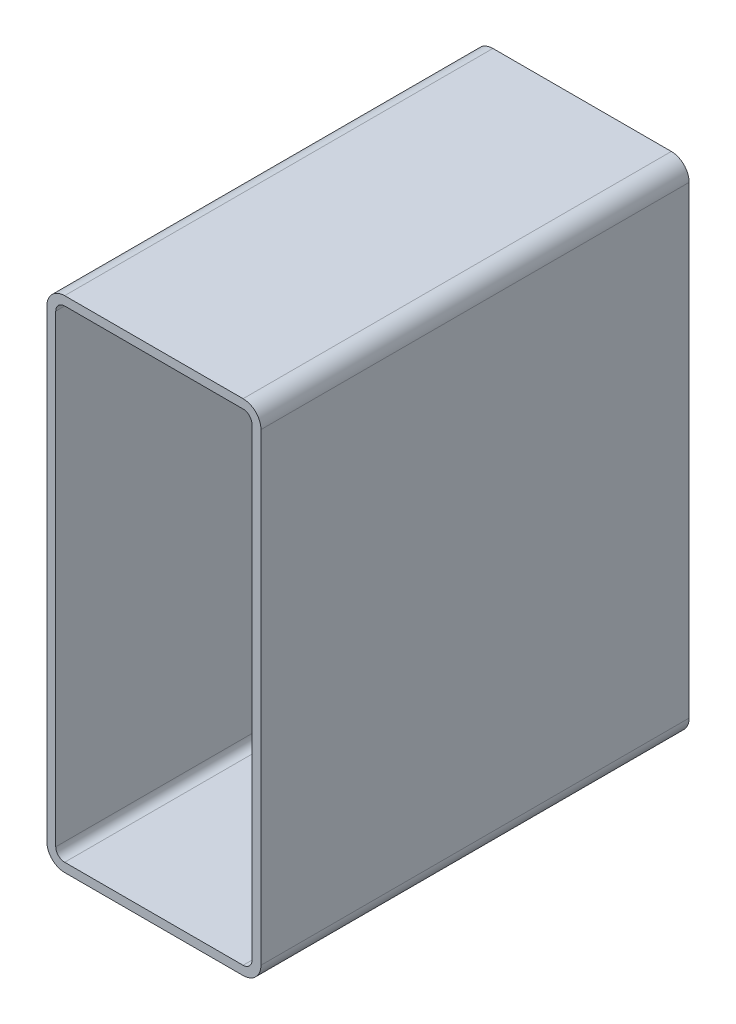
ISO-10303-21;
HEADER;
FILE_DESCRIPTION(('STEP AP214'),'2;1');
FILE_NAME('part.step','',(''),(''),'','','');
FILE_SCHEMA(('AUTOMOTIVE_DESIGN { 1 0 10303 214 1 1 1 1 }'));
ENDSEC;
DATA;
#1=APPLICATION_CONTEXT('core data for automotive mechanical design processes');
#2=APPLICATION_PROTOCOL_DEFINITION('international standard','automotive_design',2000,#1);
#3=PRODUCT_CONTEXT('',#1,'mechanical');
#4=PRODUCT('Part','Part','',(#3));
#5=PRODUCT_RELATED_PRODUCT_CATEGORY('part','',(#4));
#6=PRODUCT_DEFINITION_FORMATION('','',#4);
#7=PRODUCT_DEFINITION_CONTEXT('part definition',#1,'design');
#8=PRODUCT_DEFINITION('design','',#6,#7);
#9=PRODUCT_DEFINITION_SHAPE('','',#8);
#10=(LENGTH_UNIT() NAMED_UNIT(*) SI_UNIT(.MILLI.,.METRE.));
#11=(NAMED_UNIT(*) PLANE_ANGLE_UNIT() SI_UNIT($,.RADIAN.));
#12=(NAMED_UNIT(*) SI_UNIT($,.STERADIAN.) SOLID_ANGLE_UNIT());
#13=UNCERTAINTY_MEASURE_WITH_UNIT(LENGTH_MEASURE(1.E-05),#10,'distance_accuracy_value','');
#14=(GEOMETRIC_REPRESENTATION_CONTEXT(3) GLOBAL_UNCERTAINTY_ASSIGNED_CONTEXT((#13)) GLOBAL_UNIT_ASSIGNED_CONTEXT((#10,
#11,#12)) REPRESENTATION_CONTEXT('',''));
#15=CARTESIAN_POINT('',(0.,0.,0.));
#16=DIRECTION('',(0.,0.,1.));
#17=DIRECTION('',(1.,0.,0.));
#18=AXIS2_PLACEMENT_3D('',#15,#16,#17);
#19=CARTESIAN_POINT('',(12.7473013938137,344.728679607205,304.8));
#20=DIRECTION('',(0.,0.,1.));
#21=DIRECTION('',(1.,0.,0.));
#22=AXIS2_PLACEMENT_3D('',#19,#20,#21);
#23=PLANE('',#22);
#24=CARTESIAN_POINT('',(12.7473013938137,344.728679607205,304.8));
#25=DIRECTION('',(0.,0.,1.));
#26=DIRECTION('',(1.,0.,0.));
#27=AXIS2_PLACEMENT_3D('',#24,#25,#26);
#28=CIRCLE('',#27,12.7);
#29=CARTESIAN_POINT('',(12.7473013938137,357.428679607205,304.8));
#30=VERTEX_POINT('',#29);
#31=CARTESIAN_POINT('',(0.0473013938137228,344.728679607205,304.8));
#32=VERTEX_POINT('',#31);
#33=EDGE_CURVE('E211',#30,#32,#28,.T.);
#34=ORIENTED_EDGE('',*,*,#33,.T.);
#35=DIRECTION('',(0.,-1.,0.));
#36=VECTOR('',#35,1.);
#37=CARTESIAN_POINT('',(0.0473013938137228,14.5286796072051,304.8));
#38=LINE('',#37,#36);
#39=CARTESIAN_POINT('',(0.0473013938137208,14.5286796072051,304.8));
#40=VERTEX_POINT('',#39);
#41=EDGE_CURVE('E214',#32,#40,#38,.T.);
#42=ORIENTED_EDGE('',*,*,#41,.T.);
#43=CARTESIAN_POINT('',(12.7473013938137,14.5286796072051,304.8));
#44=DIRECTION('',(0.,0.,1.));
#45=DIRECTION('',(1.,0.,0.));
#46=AXIS2_PLACEMENT_3D('',#43,#44,#45);
#47=CIRCLE('',#46,12.7);
#48=CARTESIAN_POINT('',(12.7473013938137,1.82867960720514,304.8));
#49=VERTEX_POINT('',#48);
#50=EDGE_CURVE('E217',#40,#49,#47,.T.);
#51=ORIENTED_EDGE('',*,*,#50,.T.);
#52=DIRECTION('',(1.,0.,0.));
#53=VECTOR('',#52,1.);
#54=CARTESIAN_POINT('',(139.747301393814,1.82867960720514,304.8));
#55=LINE('',#54,#53);
#56=CARTESIAN_POINT('',(139.747301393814,1.82867960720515,304.8));
#57=VERTEX_POINT('',#56);
#58=EDGE_CURVE('E219',#49,#57,#55,.T.);
#59=ORIENTED_EDGE('',*,*,#58,.T.);
#60=CARTESIAN_POINT('',(139.747301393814,14.5286796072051,304.8));
#61=DIRECTION('',(0.,0.,1.));
#62=DIRECTION('',(1.,0.,0.));
#63=AXIS2_PLACEMENT_3D('',#60,#61,#62);
#64=CIRCLE('',#63,12.7);
#65=CARTESIAN_POINT('',(152.447301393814,14.5286796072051,304.8));
#66=VERTEX_POINT('',#65);
#67=EDGE_CURVE('E221',#57,#66,#64,.T.);
#68=ORIENTED_EDGE('',*,*,#67,.T.);
#69=DIRECTION('',(0.,1.,0.));
#70=VECTOR('',#69,1.);
#71=CARTESIAN_POINT('',(152.447301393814,344.728679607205,304.8));
#72=LINE('',#71,#70);
#73=CARTESIAN_POINT('',(152.447301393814,344.728679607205,304.8));
#74=VERTEX_POINT('',#73);
#75=EDGE_CURVE('E223',#66,#74,#72,.T.);
#76=ORIENTED_EDGE('',*,*,#75,.T.);
#77=CARTESIAN_POINT('',(139.747301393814,344.728679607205,304.8));
#78=DIRECTION('',(0.,0.,1.));
#79=DIRECTION('',(1.,0.,0.));
#80=AXIS2_PLACEMENT_3D('',#77,#78,#79);
#81=CIRCLE('',#80,12.7);
#82=CARTESIAN_POINT('',(139.747301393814,357.428679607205,304.8));
#83=VERTEX_POINT('',#82);
#84=EDGE_CURVE('E225',#74,#83,#81,.T.);
#85=ORIENTED_EDGE('',*,*,#84,.T.);
#86=DIRECTION('',(-1.,0.,0.));
#87=VECTOR('',#86,1.);
#88=CARTESIAN_POINT('',(12.7473013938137,357.428679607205,304.8));
#89=LINE('',#88,#87);
#90=EDGE_CURVE('E227',#83,#30,#89,.T.);
#91=ORIENTED_EDGE('',*,*,#90,.T.);
#92=EDGE_LOOP('',(#34,#42,#51,#59,#68,#76,#85,#91));
#93=FACE_BOUND('',#92,.T.);
#94=DIRECTION('',(0.,-1.,0.));
#95=VECTOR('',#94,1.);
#96=CARTESIAN_POINT('',(6.39730139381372,14.5286796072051,304.8));
#97=LINE('',#96,#95);
#98=CARTESIAN_POINT('',(6.39730139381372,344.728679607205,304.8));
#99=VERTEX_POINT('',#98);
#100=CARTESIAN_POINT('',(6.39730139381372,14.5286796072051,304.8));
#101=VERTEX_POINT('',#100);
#102=EDGE_CURVE('E154',#99,#101,#97,.T.);
#103=ORIENTED_EDGE('',*,*,#102,.F.);
#104=CARTESIAN_POINT('',(12.7473013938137,344.728679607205,304.8));
#105=DIRECTION('',(0.,0.,1.));
#106=DIRECTION('',(1.,0.,0.));
#107=AXIS2_PLACEMENT_3D('',#104,#105,#106);
#108=CIRCLE('',#107,6.35000000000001);
#109=CARTESIAN_POINT('',(12.7473013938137,351.078679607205,304.8));
#110=VERTEX_POINT('',#109);
#111=EDGE_CURVE('E146',#110,#99,#108,.T.);
#112=ORIENTED_EDGE('',*,*,#111,.F.);
#113=DIRECTION('',(-1.,0.,0.));
#114=VECTOR('',#113,1.);
#115=CARTESIAN_POINT('',(12.7473013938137,351.078679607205,304.8));
#116=LINE('',#115,#114);
#117=CARTESIAN_POINT('',(139.747301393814,351.078679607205,304.8));
#118=VERTEX_POINT('',#117);
#119=EDGE_CURVE('E179',#118,#110,#116,.T.);
#120=ORIENTED_EDGE('',*,*,#119,.F.);
#121=CARTESIAN_POINT('',(139.747301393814,344.728679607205,304.8));
#122=DIRECTION('',(0.,0.,1.));
#123=DIRECTION('',(1.,0.,0.));
#124=AXIS2_PLACEMENT_3D('',#121,#122,#123);
#125=CIRCLE('',#124,6.35000000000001);
#126=CARTESIAN_POINT('',(146.097301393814,344.728679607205,304.8));
#127=VERTEX_POINT('',#126);
#128=EDGE_CURVE('E177',#127,#118,#125,.T.);
#129=ORIENTED_EDGE('',*,*,#128,.F.);
#130=DIRECTION('',(0.,1.,0.));
#131=VECTOR('',#130,1.);
#132=CARTESIAN_POINT('',(146.097301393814,344.728679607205,304.8));
#133=LINE('',#132,#131);
#134=CARTESIAN_POINT('',(146.097301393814,14.5286796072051,304.8));
#135=VERTEX_POINT('',#134);
#136=EDGE_CURVE('E175',#135,#127,#133,.T.);
#137=ORIENTED_EDGE('',*,*,#136,.F.);
#138=CARTESIAN_POINT('',(139.747301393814,14.5286796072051,304.8));
#139=DIRECTION('',(0.,0.,1.));
#140=DIRECTION('',(1.,0.,0.));
#141=AXIS2_PLACEMENT_3D('',#138,#139,#140);
#142=CIRCLE('',#141,6.35);
#143=CARTESIAN_POINT('',(139.747301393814,8.17867960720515,304.8));
#144=VERTEX_POINT('',#143);
#145=EDGE_CURVE('E173',#144,#135,#142,.T.);
#146=ORIENTED_EDGE('',*,*,#145,.F.);
#147=DIRECTION('',(1.,0.,0.));
#148=VECTOR('',#147,1.);
#149=CARTESIAN_POINT('',(139.747301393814,8.17867960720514,304.8));
#150=LINE('',#149,#148);
#151=CARTESIAN_POINT('',(12.7473013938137,8.17867960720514,304.8));
#152=VERTEX_POINT('',#151);
#153=EDGE_CURVE('E169',#152,#144,#150,.T.);
#154=ORIENTED_EDGE('',*,*,#153,.F.);
#155=CARTESIAN_POINT('',(12.7473013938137,14.5286796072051,304.8));
#156=DIRECTION('',(0.,0.,1.));
#157=DIRECTION('',(1.,0.,0.));
#158=AXIS2_PLACEMENT_3D('',#155,#156,#157);
#159=CIRCLE('',#158,6.35);
#160=EDGE_CURVE('E167',#101,#152,#159,.T.);
#161=ORIENTED_EDGE('',*,*,#160,.F.);
#162=EDGE_LOOP('',(#103,#112,#120,#129,#137,#146,#154,#161));
#163=FACE_BOUND('',#162,.T.);
#164=ADVANCED_FACE('F33',(#93,#163),#23,.T.);
#165=CARTESIAN_POINT('',(12.7473013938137,344.728679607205,0.));
#166=DIRECTION('',(0.,0.,1.));
#167=DIRECTION('',(1.,0.,0.));
#168=AXIS2_PLACEMENT_3D('',#165,#166,#167);
#169=PLANE('',#168);
#170=CARTESIAN_POINT('',(12.7473013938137,344.728679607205,0.));
#171=DIRECTION('',(0.,0.,1.));
#172=DIRECTION('',(1.,0.,0.));
#173=AXIS2_PLACEMENT_3D('',#170,#171,#172);
#174=CIRCLE('',#173,12.7);
#175=CARTESIAN_POINT('',(12.7473013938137,357.428679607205,0.));
#176=VERTEX_POINT('',#175);
#177=CARTESIAN_POINT('',(0.0473013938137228,344.728679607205,0.));
#178=VERTEX_POINT('',#177);
#179=EDGE_CURVE('E162',#176,#178,#174,.T.);
#180=ORIENTED_EDGE('',*,*,#179,.F.);
#181=DIRECTION('',(-1.,0.,0.));
#182=VECTOR('',#181,1.);
#183=CARTESIAN_POINT('',(12.7473013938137,357.428679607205,0.));
#184=LINE('',#183,#182);
#185=CARTESIAN_POINT('',(139.747301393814,357.428679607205,0.));
#186=VERTEX_POINT('',#185);
#187=EDGE_CURVE('E215',#186,#176,#184,.T.);
#188=ORIENTED_EDGE('',*,*,#187,.F.);
#189=CARTESIAN_POINT('',(139.747301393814,344.728679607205,0.));
#190=DIRECTION('',(0.,0.,1.));
#191=DIRECTION('',(1.,0.,0.));
#192=AXIS2_PLACEMENT_3D('',#189,#190,#191);
#193=CIRCLE('',#192,12.7);
#194=CARTESIAN_POINT('',(152.447301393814,344.728679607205,0.));
#195=VERTEX_POINT('',#194);
#196=EDGE_CURVE('E242',#195,#186,#193,.T.);
#197=ORIENTED_EDGE('',*,*,#196,.F.);
#198=DIRECTION('',(0.,1.,0.));
#199=VECTOR('',#198,1.);
#200=CARTESIAN_POINT('',(152.447301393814,344.728679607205,0.));
#201=LINE('',#200,#199);
#202=CARTESIAN_POINT('',(152.447301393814,14.5286796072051,0.));
#203=VERTEX_POINT('',#202);
#204=EDGE_CURVE('E240',#203,#195,#201,.T.);
#205=ORIENTED_EDGE('',*,*,#204,.F.);
#206=CARTESIAN_POINT('',(139.747301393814,14.5286796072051,0.));
#207=DIRECTION('',(0.,0.,1.));
#208=DIRECTION('',(1.,0.,0.));
#209=AXIS2_PLACEMENT_3D('',#206,#207,#208);
#210=CIRCLE('',#209,12.7);
#211=CARTESIAN_POINT('',(139.747301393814,1.82867960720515,0.));
#212=VERTEX_POINT('',#211);
#213=EDGE_CURVE('E238',#212,#203,#210,.T.);
#214=ORIENTED_EDGE('',*,*,#213,.F.);
#215=DIRECTION('',(1.,0.,0.));
#216=VECTOR('',#215,1.);
#217=CARTESIAN_POINT('',(139.747301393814,1.82867960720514,0.));
#218=LINE('',#217,#216);
#219=CARTESIAN_POINT('',(12.7473013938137,1.82867960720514,0.));
#220=VERTEX_POINT('',#219);
#221=EDGE_CURVE('E236',#220,#212,#218,.T.);
#222=ORIENTED_EDGE('',*,*,#221,.F.);
#223=CARTESIAN_POINT('',(12.7473013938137,14.5286796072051,0.));
#224=DIRECTION('',(0.,0.,1.));
#225=DIRECTION('',(1.,0.,0.));
#226=AXIS2_PLACEMENT_3D('',#223,#224,#225);
#227=CIRCLE('',#226,12.7);
#228=CARTESIAN_POINT('',(0.0473013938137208,14.5286796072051,0.));
#229=VERTEX_POINT('',#228);
#230=EDGE_CURVE('E234',#229,#220,#227,.T.);
#231=ORIENTED_EDGE('',*,*,#230,.F.);
#232=DIRECTION('',(0.,-1.,0.));
#233=VECTOR('',#232,1.);
#234=CARTESIAN_POINT('',(0.0473013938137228,14.5286796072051,0.));
#235=LINE('',#234,#233);
#236=EDGE_CURVE('E232',#178,#229,#235,.T.);
#237=ORIENTED_EDGE('',*,*,#236,.F.);
#238=EDGE_LOOP('',(#180,#188,#197,#205,#214,#222,#231,#237));
#239=FACE_BOUND('',#238,.T.);
#240=CARTESIAN_POINT('',(12.7473013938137,344.728679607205,0.));
#241=DIRECTION('',(0.,0.,1.));
#242=DIRECTION('',(1.,0.,0.));
#243=AXIS2_PLACEMENT_3D('',#240,#241,#242);
#244=CIRCLE('',#243,6.35000000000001);
#245=CARTESIAN_POINT('',(12.7473013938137,351.078679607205,0.));
#246=VERTEX_POINT('',#245);
#247=CARTESIAN_POINT('',(6.39730139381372,344.728679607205,0.));
#248=VERTEX_POINT('',#247);
#249=EDGE_CURVE('E56',#246,#248,#244,.T.);
#250=ORIENTED_EDGE('',*,*,#249,.T.);
#251=DIRECTION('',(0.,-1.,0.));
#252=VECTOR('',#251,1.);
#253=CARTESIAN_POINT('',(6.39730139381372,14.5286796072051,0.));
#254=LINE('',#253,#252);
#255=CARTESIAN_POINT('',(6.39730139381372,14.5286796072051,0.));
#256=VERTEX_POINT('',#255);
#257=EDGE_CURVE('E161',#248,#256,#254,.T.);
#258=ORIENTED_EDGE('',*,*,#257,.T.);
#259=CARTESIAN_POINT('',(12.7473013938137,14.5286796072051,0.));
#260=DIRECTION('',(0.,0.,1.));
#261=DIRECTION('',(1.,0.,0.));
#262=AXIS2_PLACEMENT_3D('',#259,#260,#261);
#263=CIRCLE('',#262,6.35);
#264=CARTESIAN_POINT('',(12.7473013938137,8.17867960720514,0.));
#265=VERTEX_POINT('',#264);
#266=EDGE_CURVE('E183',#256,#265,#263,.T.);
#267=ORIENTED_EDGE('',*,*,#266,.T.);
#268=DIRECTION('',(1.,0.,0.));
#269=VECTOR('',#268,1.);
#270=CARTESIAN_POINT('',(139.747301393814,8.17867960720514,0.));
#271=LINE('',#270,#269);
#272=CARTESIAN_POINT('',(139.747301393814,8.17867960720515,0.));
#273=VERTEX_POINT('',#272);
#274=EDGE_CURVE('E186',#265,#273,#271,.T.);
#275=ORIENTED_EDGE('',*,*,#274,.T.);
#276=CARTESIAN_POINT('',(139.747301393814,14.5286796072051,0.));
#277=DIRECTION('',(0.,0.,1.));
#278=DIRECTION('',(1.,0.,0.));
#279=AXIS2_PLACEMENT_3D('',#276,#277,#278);
#280=CIRCLE('',#279,6.35);
#281=CARTESIAN_POINT('',(146.097301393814,14.5286796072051,0.));
#282=VERTEX_POINT('',#281);
#283=EDGE_CURVE('E189',#273,#282,#280,.T.);
#284=ORIENTED_EDGE('',*,*,#283,.T.);
#285=DIRECTION('',(0.,1.,0.));
#286=VECTOR('',#285,1.);
#287=CARTESIAN_POINT('',(146.097301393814,344.728679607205,0.));
#288=LINE('',#287,#286);
#289=CARTESIAN_POINT('',(146.097301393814,344.728679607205,0.));
#290=VERTEX_POINT('',#289);
#291=EDGE_CURVE('E192',#282,#290,#288,.T.);
#292=ORIENTED_EDGE('',*,*,#291,.T.);
#293=CARTESIAN_POINT('',(139.747301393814,344.728679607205,0.));
#294=DIRECTION('',(0.,0.,1.));
#295=DIRECTION('',(1.,0.,0.));
#296=AXIS2_PLACEMENT_3D('',#293,#294,#295);
#297=CIRCLE('',#296,6.35000000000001);
#298=CARTESIAN_POINT('',(139.747301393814,351.078679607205,0.));
#299=VERTEX_POINT('',#298);
#300=EDGE_CURVE('E195',#290,#299,#297,.T.);
#301=ORIENTED_EDGE('',*,*,#300,.T.);
#302=DIRECTION('',(-1.,0.,0.));
#303=VECTOR('',#302,1.);
#304=CARTESIAN_POINT('',(12.7473013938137,351.078679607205,0.));
#305=LINE('',#304,#303);
#306=EDGE_CURVE('E155',#299,#246,#305,.T.);
#307=ORIENTED_EDGE('',*,*,#306,.T.);
#308=EDGE_LOOP('',(#250,#258,#267,#275,#284,#292,#301,#307));
#309=FACE_BOUND('',#308,.T.);
#310=ADVANCED_FACE('F272',(#239,#309),#169,.F.);
#311=CARTESIAN_POINT('',(12.7473013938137,344.728679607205,304.8));
#312=DIRECTION('',(0.,0.,-1.));
#313=DIRECTION('',(-1.,0.,0.));
#314=AXIS2_PLACEMENT_3D('',#311,#312,#313);
#315=CYLINDRICAL_SURFACE('',#314,12.7);
#316=ORIENTED_EDGE('',*,*,#179,.T.);
#317=DIRECTION('',(0.,0.,-1.));
#318=VECTOR('',#317,1.);
#319=CARTESIAN_POINT('',(0.0473013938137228,344.728679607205,304.8));
#320=LINE('',#319,#318);
#321=EDGE_CURVE('E11',#32,#178,#320,.T.);
#322=ORIENTED_EDGE('',*,*,#321,.F.);
#323=ORIENTED_EDGE('',*,*,#33,.F.);
#324=DIRECTION('',(0.,0.,-1.));
#325=VECTOR('',#324,1.);
#326=CARTESIAN_POINT('',(12.7473013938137,357.428679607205,304.8));
#327=LINE('',#326,#325);
#328=EDGE_CURVE('E229',#30,#176,#327,.T.);
#329=ORIENTED_EDGE('',*,*,#328,.T.);
#330=EDGE_LOOP('',(#316,#322,#323,#329));
#331=FACE_BOUND('',#330,.T.);
#332=ADVANCED_FACE('F35',(#331),#315,.T.);
#333=CARTESIAN_POINT('',(0.0473013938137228,14.5286796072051,304.8));
#334=DIRECTION('',(1.,0.,0.));
#335=DIRECTION('',(0.,0.,-1.));
#336=AXIS2_PLACEMENT_3D('',#333,#334,#335);
#337=PLANE('',#336);
#338=ORIENTED_EDGE('',*,*,#236,.T.);
#339=DIRECTION('',(0.,0.,-1.));
#340=VECTOR('',#339,1.);
#341=CARTESIAN_POINT('',(0.0473013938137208,14.5286796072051,304.8));
#342=LINE('',#341,#340);
#343=EDGE_CURVE('E41',#40,#229,#342,.T.);
#344=ORIENTED_EDGE('',*,*,#343,.F.);
#345=ORIENTED_EDGE('',*,*,#41,.F.);
#346=ORIENTED_EDGE('',*,*,#321,.T.);
#347=EDGE_LOOP('',(#338,#344,#345,#346));
#348=FACE_BOUND('',#347,.T.);
#349=ADVANCED_FACE('F289',(#348),#337,.F.);
#350=CARTESIAN_POINT('',(12.7473013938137,14.5286796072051,304.8));
#351=DIRECTION('',(0.,0.,-1.));
#352=DIRECTION('',(-1.,0.,0.));
#353=AXIS2_PLACEMENT_3D('',#350,#351,#352);
#354=CYLINDRICAL_SURFACE('',#353,12.7);
#355=ORIENTED_EDGE('',*,*,#230,.T.);
#356=DIRECTION('',(0.,0.,-1.));
#357=VECTOR('',#356,1.);
#358=CARTESIAN_POINT('',(12.7473013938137,1.82867960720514,304.8));
#359=LINE('',#358,#357);
#360=EDGE_CURVE('E259',#49,#220,#359,.T.);
#361=ORIENTED_EDGE('',*,*,#360,.F.);
#362=ORIENTED_EDGE('',*,*,#50,.F.);
#363=ORIENTED_EDGE('',*,*,#343,.T.);
#364=EDGE_LOOP('',(#355,#361,#362,#363));
#365=FACE_BOUND('',#364,.T.);
#366=ADVANCED_FACE('F266',(#365),#354,.T.);
#367=CARTESIAN_POINT('',(139.747301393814,1.82867960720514,304.8));
#368=DIRECTION('',(0.,1.,0.));
#369=DIRECTION('',(0.,0.,1.));
#370=AXIS2_PLACEMENT_3D('',#367,#368,#369);
#371=PLANE('',#370);
#372=ORIENTED_EDGE('',*,*,#221,.T.);
#373=DIRECTION('',(0.,0.,-1.));
#374=VECTOR('',#373,1.);
#375=CARTESIAN_POINT('',(139.747301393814,1.82867960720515,304.8));
#376=LINE('',#375,#374);
#377=EDGE_CURVE('E256',#57,#212,#376,.T.);
#378=ORIENTED_EDGE('',*,*,#377,.F.);
#379=ORIENTED_EDGE('',*,*,#58,.F.);
#380=ORIENTED_EDGE('',*,*,#360,.T.);
#381=EDGE_LOOP('',(#372,#378,#379,#380));
#382=FACE_BOUND('',#381,.T.);
#383=ADVANCED_FACE('F278',(#382),#371,.F.);
#384=CARTESIAN_POINT('',(139.747301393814,14.5286796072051,304.8));
#385=DIRECTION('',(0.,0.,-1.));
#386=DIRECTION('',(-1.,0.,0.));
#387=AXIS2_PLACEMENT_3D('',#384,#385,#386);
#388=CYLINDRICAL_SURFACE('',#387,12.7);
#389=ORIENTED_EDGE('',*,*,#213,.T.);
#390=DIRECTION('',(0.,0.,-1.));
#391=VECTOR('',#390,1.);
#392=CARTESIAN_POINT('',(152.447301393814,14.5286796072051,304.8));
#393=LINE('',#392,#391);
#394=EDGE_CURVE('E253',#66,#203,#393,.T.);
#395=ORIENTED_EDGE('',*,*,#394,.F.);
#396=ORIENTED_EDGE('',*,*,#67,.F.);
#397=ORIENTED_EDGE('',*,*,#377,.T.);
#398=EDGE_LOOP('',(#389,#395,#396,#397));
#399=FACE_BOUND('',#398,.T.);
#400=ADVANCED_FACE('F282',(#399),#388,.T.);
#401=CARTESIAN_POINT('',(152.447301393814,344.728679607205,304.8));
#402=DIRECTION('',(-1.,0.,0.));
#403=DIRECTION('',(0.,0.,1.));
#404=AXIS2_PLACEMENT_3D('',#401,#402,#403);
#405=PLANE('',#404);
#406=ORIENTED_EDGE('',*,*,#204,.T.);
#407=DIRECTION('',(0.,0.,-1.));
#408=VECTOR('',#407,1.);
#409=CARTESIAN_POINT('',(152.447301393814,344.728679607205,304.8));
#410=LINE('',#409,#408);
#411=EDGE_CURVE('E250',#74,#195,#410,.T.);
#412=ORIENTED_EDGE('',*,*,#411,.F.);
#413=ORIENTED_EDGE('',*,*,#75,.F.);
#414=ORIENTED_EDGE('',*,*,#394,.T.);
#415=EDGE_LOOP('',(#406,#412,#413,#414));
#416=FACE_BOUND('',#415,.T.);
#417=ADVANCED_FACE('F302',(#416),#405,.F.);
#418=CARTESIAN_POINT('',(139.747301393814,344.728679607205,304.8));
#419=DIRECTION('',(0.,0.,-1.));
#420=DIRECTION('',(-1.,0.,0.));
#421=AXIS2_PLACEMENT_3D('',#418,#419,#420);
#422=CYLINDRICAL_SURFACE('',#421,12.7);
#423=ORIENTED_EDGE('',*,*,#196,.T.);
#424=DIRECTION('',(0.,0.,-1.));
#425=VECTOR('',#424,1.);
#426=CARTESIAN_POINT('',(139.747301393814,357.428679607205,304.8));
#427=LINE('',#426,#425);
#428=EDGE_CURVE('E247',#83,#186,#427,.T.);
#429=ORIENTED_EDGE('',*,*,#428,.F.);
#430=ORIENTED_EDGE('',*,*,#84,.F.);
#431=ORIENTED_EDGE('',*,*,#411,.T.);
#432=EDGE_LOOP('',(#423,#429,#430,#431));
#433=FACE_BOUND('',#432,.T.);
#434=ADVANCED_FACE('F300',(#433),#422,.T.);
#435=CARTESIAN_POINT('',(12.7473013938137,357.428679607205,304.8));
#436=DIRECTION('',(0.,-1.,0.));
#437=DIRECTION('',(0.,0.,-1.));
#438=AXIS2_PLACEMENT_3D('',#435,#436,#437);
#439=PLANE('',#438);
#440=ORIENTED_EDGE('',*,*,#187,.T.);
#441=ORIENTED_EDGE('',*,*,#328,.F.);
#442=ORIENTED_EDGE('',*,*,#90,.F.);
#443=ORIENTED_EDGE('',*,*,#428,.T.);
#444=EDGE_LOOP('',(#440,#441,#442,#443));
#445=FACE_BOUND('',#444,.T.);
#446=ADVANCED_FACE('F295',(#445),#439,.F.);
#447=CARTESIAN_POINT('',(12.7473013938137,344.728679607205,304.8));
#448=DIRECTION('',(0.,0.,-1.));
#449=DIRECTION('',(-1.,0.,0.));
#450=AXIS2_PLACEMENT_3D('',#447,#448,#449);
#451=CYLINDRICAL_SURFACE('',#450,6.35000000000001);
#452=ORIENTED_EDGE('',*,*,#249,.F.);
#453=DIRECTION('',(0.,0.,-1.));
#454=VECTOR('',#453,1.);
#455=CARTESIAN_POINT('',(12.7473013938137,351.078679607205,304.8));
#456=LINE('',#455,#454);
#457=EDGE_CURVE('E150',#110,#246,#456,.T.);
#458=ORIENTED_EDGE('',*,*,#457,.F.);
#459=ORIENTED_EDGE('',*,*,#111,.T.);
#460=DIRECTION('',(0.,0.,-1.));
#461=VECTOR('',#460,1.);
#462=CARTESIAN_POINT('',(6.39730139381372,344.728679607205,304.8));
#463=LINE('',#462,#461);
#464=EDGE_CURVE('E149',#99,#248,#463,.T.);
#465=ORIENTED_EDGE('',*,*,#464,.T.);
#466=EDGE_LOOP('',(#452,#458,#459,#465));
#467=FACE_BOUND('',#466,.T.);
#468=ADVANCED_FACE('F148',(#467),#451,.F.);
#469=CARTESIAN_POINT('',(6.39730139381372,14.5286796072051,304.8));
#470=DIRECTION('',(1.,0.,0.));
#471=DIRECTION('',(0.,0.,-1.));
#472=AXIS2_PLACEMENT_3D('',#469,#470,#471);
#473=PLANE('',#472);
#474=ORIENTED_EDGE('',*,*,#257,.F.);
#475=ORIENTED_EDGE('',*,*,#464,.F.);
#476=ORIENTED_EDGE('',*,*,#102,.T.);
#477=DIRECTION('',(0.,0.,-1.));
#478=VECTOR('',#477,1.);
#479=CARTESIAN_POINT('',(6.39730139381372,14.5286796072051,304.8));
#480=LINE('',#479,#478);
#481=EDGE_CURVE('E163',#101,#256,#480,.T.);
#482=ORIENTED_EDGE('',*,*,#481,.T.);
#483=EDGE_LOOP('',(#474,#475,#476,#482));
#484=FACE_BOUND('',#483,.T.);
#485=ADVANCED_FACE('F158',(#484),#473,.T.);
#486=CARTESIAN_POINT('',(12.7473013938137,14.5286796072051,304.8));
#487=DIRECTION('',(0.,0.,-1.));
#488=DIRECTION('',(-1.,0.,0.));
#489=AXIS2_PLACEMENT_3D('',#486,#487,#488);
#490=CYLINDRICAL_SURFACE('',#489,6.35);
#491=ORIENTED_EDGE('',*,*,#266,.F.);
#492=ORIENTED_EDGE('',*,*,#481,.F.);
#493=ORIENTED_EDGE('',*,*,#160,.T.);
#494=DIRECTION('',(0.,0.,-1.));
#495=VECTOR('',#494,1.);
#496=CARTESIAN_POINT('',(12.7473013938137,8.17867960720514,304.8));
#497=LINE('',#496,#495);
#498=EDGE_CURVE('E208',#152,#265,#497,.T.);
#499=ORIENTED_EDGE('',*,*,#498,.T.);
#500=EDGE_LOOP('',(#491,#492,#493,#499));
#501=FACE_BOUND('',#500,.T.);
#502=ADVANCED_FACE('F327',(#501),#490,.F.);
#503=CARTESIAN_POINT('',(139.747301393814,8.17867960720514,304.8));
#504=DIRECTION('',(0.,1.,0.));
#505=DIRECTION('',(0.,0.,1.));
#506=AXIS2_PLACEMENT_3D('',#503,#504,#505);
#507=PLANE('',#506);
#508=ORIENTED_EDGE('',*,*,#274,.F.);
#509=ORIENTED_EDGE('',*,*,#498,.F.);
#510=ORIENTED_EDGE('',*,*,#153,.T.);
#511=DIRECTION('',(0.,0.,-1.));
#512=VECTOR('',#511,1.);
#513=CARTESIAN_POINT('',(139.747301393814,8.17867960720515,304.8));
#514=LINE('',#513,#512);
#515=EDGE_CURVE('E206',#144,#273,#514,.T.);
#516=ORIENTED_EDGE('',*,*,#515,.T.);
#517=EDGE_LOOP('',(#508,#509,#510,#516));
#518=FACE_BOUND('',#517,.T.);
#519=ADVANCED_FACE('F331',(#518),#507,.T.);
#520=CARTESIAN_POINT('',(139.747301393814,14.5286796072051,304.8));
#521=DIRECTION('',(0.,0.,-1.));
#522=DIRECTION('',(-1.,0.,0.));
#523=AXIS2_PLACEMENT_3D('',#520,#521,#522);
#524=CYLINDRICAL_SURFACE('',#523,6.35);
#525=ORIENTED_EDGE('',*,*,#283,.F.);
#526=ORIENTED_EDGE('',*,*,#515,.F.);
#527=ORIENTED_EDGE('',*,*,#145,.T.);
#528=DIRECTION('',(0.,0.,-1.));
#529=VECTOR('',#528,1.);
#530=CARTESIAN_POINT('',(146.097301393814,14.5286796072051,304.8));
#531=LINE('',#530,#529);
#532=EDGE_CURVE('E204',#135,#282,#531,.T.);
#533=ORIENTED_EDGE('',*,*,#532,.T.);
#534=EDGE_LOOP('',(#525,#526,#527,#533));
#535=FACE_BOUND('',#534,.T.);
#536=ADVANCED_FACE('F337',(#535),#524,.F.);
#537=CARTESIAN_POINT('',(146.097301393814,344.728679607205,304.8));
#538=DIRECTION('',(-1.,0.,0.));
#539=DIRECTION('',(0.,0.,1.));
#540=AXIS2_PLACEMENT_3D('',#537,#538,#539);
#541=PLANE('',#540);
#542=ORIENTED_EDGE('',*,*,#291,.F.);
#543=ORIENTED_EDGE('',*,*,#532,.F.);
#544=ORIENTED_EDGE('',*,*,#136,.T.);
#545=DIRECTION('',(0.,0.,-1.));
#546=VECTOR('',#545,1.);
#547=CARTESIAN_POINT('',(146.097301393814,344.728679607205,304.8));
#548=LINE('',#547,#546);
#549=EDGE_CURVE('E202',#127,#290,#548,.T.);
#550=ORIENTED_EDGE('',*,*,#549,.T.);
#551=EDGE_LOOP('',(#542,#543,#544,#550));
#552=FACE_BOUND('',#551,.T.);
#553=ADVANCED_FACE('F341',(#552),#541,.T.);
#554=CARTESIAN_POINT('',(139.747301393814,344.728679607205,304.8));
#555=DIRECTION('',(0.,0.,-1.));
#556=DIRECTION('',(-1.,0.,0.));
#557=AXIS2_PLACEMENT_3D('',#554,#555,#556);
#558=CYLINDRICAL_SURFACE('',#557,6.35000000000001);
#559=ORIENTED_EDGE('',*,*,#300,.F.);
#560=ORIENTED_EDGE('',*,*,#549,.F.);
#561=ORIENTED_EDGE('',*,*,#128,.T.);
#562=DIRECTION('',(0.,0.,-1.));
#563=VECTOR('',#562,1.);
#564=CARTESIAN_POINT('',(139.747301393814,351.078679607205,304.8));
#565=LINE('',#564,#563);
#566=EDGE_CURVE('E48',#118,#299,#565,.T.);
#567=ORIENTED_EDGE('',*,*,#566,.T.);
#568=EDGE_LOOP('',(#559,#560,#561,#567));
#569=FACE_BOUND('',#568,.T.);
#570=ADVANCED_FACE('F345',(#569),#558,.F.);
#571=CARTESIAN_POINT('',(12.7473013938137,351.078679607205,304.8));
#572=DIRECTION('',(0.,-1.,0.));
#573=DIRECTION('',(0.,0.,-1.));
#574=AXIS2_PLACEMENT_3D('',#571,#572,#573);
#575=PLANE('',#574);
#576=ORIENTED_EDGE('',*,*,#306,.F.);
#577=ORIENTED_EDGE('',*,*,#566,.F.);
#578=ORIENTED_EDGE('',*,*,#119,.T.);
#579=ORIENTED_EDGE('',*,*,#457,.T.);
#580=EDGE_LOOP('',(#576,#577,#578,#579));
#581=FACE_BOUND('',#580,.T.);
#582=ADVANCED_FACE('F349',(#581),#575,.T.);
#583=CLOSED_SHELL('',(#164,#310,#332,#349,#366,#383,#400,#417,#434,#446,#468,#485,#502,#519,
#536,#553,#570,#582));
#584=MANIFOLD_SOLID_BREP('B2',#583);
#585=ADVANCED_BREP_SHAPE_REPRESENTATION('',(#18,#584),#14);
#586=SHAPE_DEFINITION_REPRESENTATION(#9,#585);
ENDSEC;
END-ISO-10303-21;
